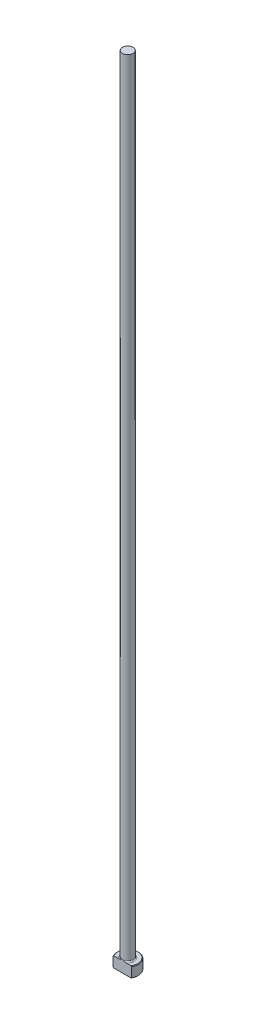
from build123d import *

# Parameters (mm, degrees)
CHAMFER1_SIZE = 0.254
FILLET1_R     = 0.508
KEY_DEPTH     = 356.663777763


with BuildPart() as part:
    # Sketch1 → Revolve1 (revolve)
    with BuildSketch(Plane.XY, mode=Mode.PRIVATE) as revolve1_sk:
        Polygon((0, 0), (-4.7625, 0), (-4.7625, 4.7498), (-2.38125, 4.7498), (-2.38125, 355.6), (0, 355.6), align=None)
    revolve(revolve1_sk.sketch.rotate(Axis((0, 259.958771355, 0), (0, -1, 0)), 270), axis=Axis((0, 259.958771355, 0), (0, -1, 0)))

    # Chamfer1
    chamfer1_edges = [part.edges().sort_by_distance(p)[0] for p in [
        (0, 4.7498, -4.7625),
        (0, 0, -4.7625),
    ]]
    chamfer(chamfer1_edges, length=CHAMFER1_SIZE)

    # Fillet1
    fillet1_edges = [part.edges().sort_by_distance(p)[0] for p in [
        (0, 4.7498, -2.38125),
    ]]
    fillet(fillet1_edges, radius=FILLET1_R)

    # Sketch2 → KEY (cut, through all)
    with BuildSketch(Plane.XZ):
        with BuildLine():
            Line((-4.124445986, 2.38125), (4.124445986, 2.38125))
            ThreePointArc((4.124445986, 2.38125), (0, 4.7625), (-4.124445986, 2.38125))
        make_face()
    extrude(amount=-KEY_DEPTH, mode=Mode.SUBTRACT)


solid = part.part
